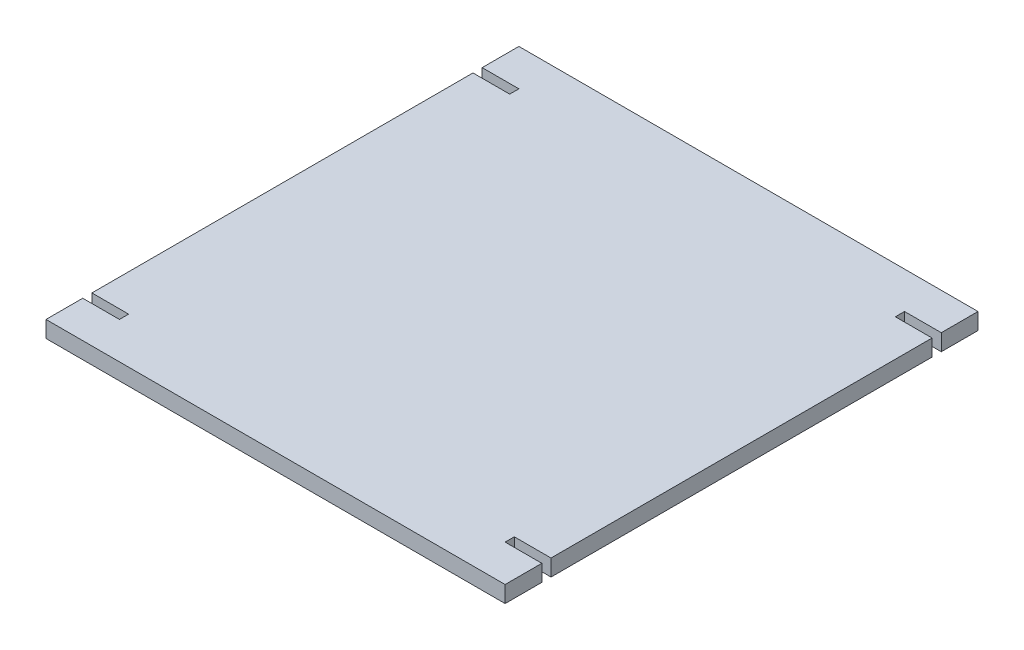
from build123d import *

# Parameters (mm, degrees)
BOSS_EXTRUDE1_DEPTH = 18


with BuildPart() as part:
    # Sketch1 → Boss-Extrude1 (new body)
    with BuildSketch(Plane(origin=(0, 0, 0), x_dir=(1, 0, 0), z_dir=(0, 1, 0))):
        Polygon((-301.875, 208.229166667), (198.125, 208.229166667), (198.125, 168.229166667), (158.125, 168.229166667), (158.125, 158.229166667), (198.125, 158.229166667), (198.125, -256.770833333), (158.125, -256.770833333), (158.125, -266.770833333), (198.125, -266.770833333), (198.125, -306.770833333), (-301.875, -306.770833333), (-301.875, -266.770833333), (-261.875, -266.770833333), (-261.875, -256.770833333), (-301.875, -256.770833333), (-301.875, 158.229166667), (-261.875, 158.229166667), (-261.875, 168.229166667), (-301.875, 168.229166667), align=None)
    extrude(amount=BOSS_EXTRUDE1_DEPTH)


solid = part.part
